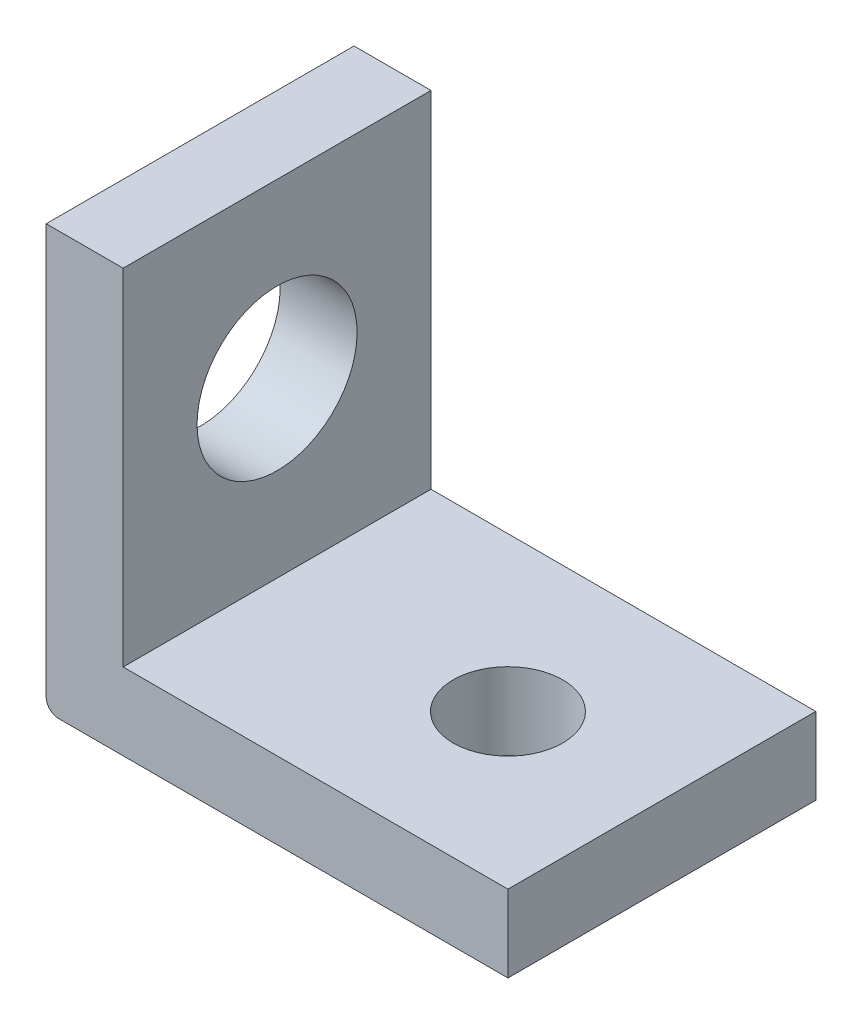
from build123d import *

# Parameters (mm, degrees)
BOSS_EXTRUDE1_DEPTH       = 6.35
F_4_CLEARANCE_HOLE1_D     = 3.302
F_4_CLEARANCE_HOLE1_DEPTH = 57.15
F_4_CLEARANCE_HOLE1_TIP   = 0.992020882
F_4_40_TAPPED_HOLE1_D     = 2.2606


with BuildPart() as part:
    # Sketch1 → Boss-Extrude1 (new body)
    with BuildSketch(Plane.XY):
        with BuildLine():
            Line((0, 0), (0, 7.1247))
            Line((0, 7.1247), (-1.5875, 7.1247))
            Line((-1.5875, 7.1247), (-1.5875, -1.3335))
            ThreePointArc((-1.5875, -1.3335), (-1.513105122, -1.513105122), (-1.3335, -1.5875))
            Line((-1.3335, -1.5875), (7.9375, -1.5875))
            Line((7.9375, -1.5875), (7.9375, 0))
            Line((7.9375, 0), (0, 0))
        make_face()
    extrude(amount=BOSS_EXTRUDE1_DEPTH)

    # 4 Clearance Hole1
    with Locations(Plane(origin=(0, 0, 0), x_dir=(0, 0, -1), z_dir=(1, 0, 0))):
        with Locations((-3.175, 3.5687)):
            Hole(F_4_CLEARANCE_HOLE1_D / 2, depth=F_4_CLEARANCE_HOLE1_DEPTH)
            with Locations((0, 0, -(F_4_CLEARANCE_HOLE1_DEPTH + F_4_CLEARANCE_HOLE1_TIP / 2))):  # 118° drill point
                Cone(0, F_4_CLEARANCE_HOLE1_D / 2, F_4_CLEARANCE_HOLE1_TIP, mode=Mode.SUBTRACT)

    # 4-40 Tapped Hole1 (through all)
    with Locations(Plane(origin=(0, 0, 0), x_dir=(1, 0, 0), z_dir=(0, 1, 0))):
        with Locations((4.7625, -3.175)):
            Hole(F_4_40_TAPPED_HOLE1_D / 2)


solid = part.part
